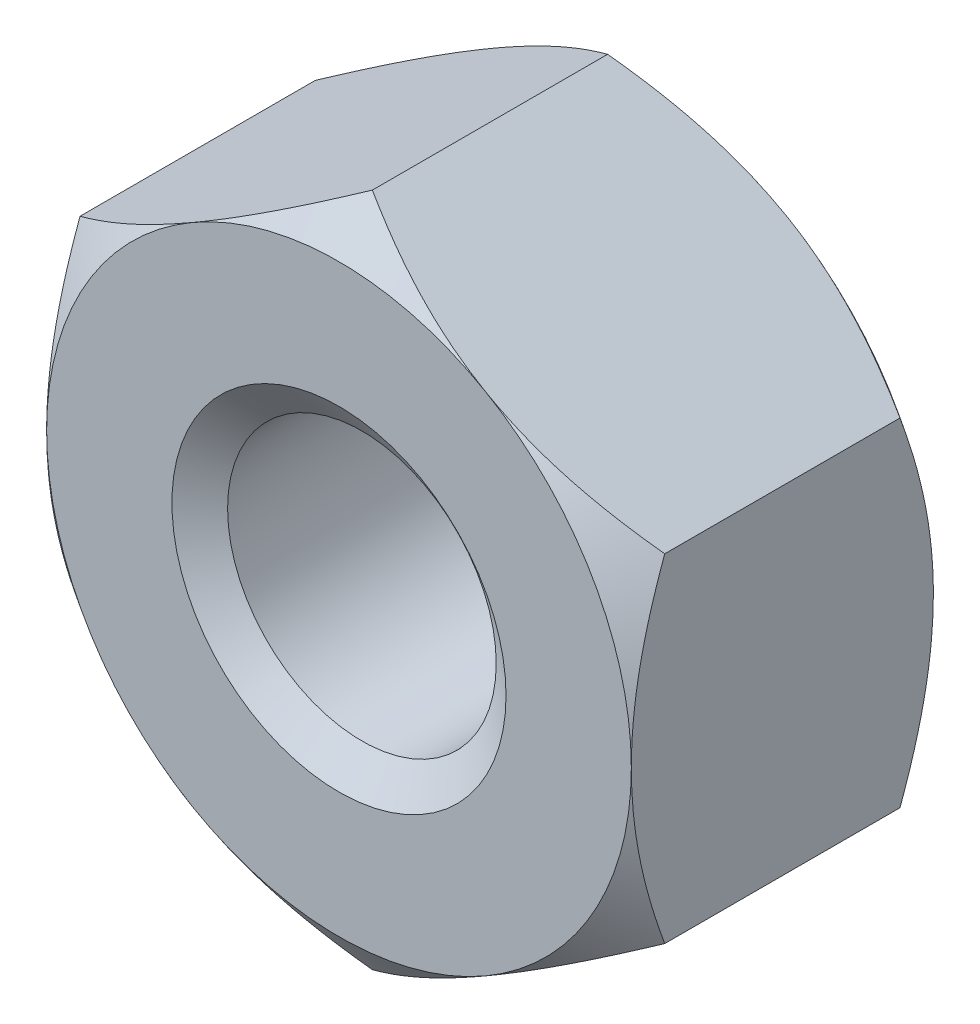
from build123d import *

# Parameters (mm, degrees)
BASENUTSKE_R  = 2.5527
BASENUT_DEPTH = 5.7404


with BuildPart() as part:
    # BaseNutSke → BaseNut (new body)
    with BuildSketch(Plane.XY):
        Polygon((5.55625, 3.207902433), (5.55625, -3.207902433), (0, -6.415804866), (-5.55625, -3.207902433), (-5.55625, 3.207902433), (0, 6.415804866), align=None)
        Circle(BASENUTSKE_R, mode=Mode.SUBTRACT)
    extrude(amount=-BASENUT_DEPTH)

    # Sketch3 → Double-Chamfer (revolve, cut)
    with BuildSketch(Plane(origin=(0, 0, 0), x_dir=(0, 0, -1), z_dir=(1, 0, 0))):
        Polygon((5.7404, 5.55625), (5.1054, 6.415804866), (5.1054, 19.115804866), (18.4404, 19.115804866), (18.4404, 5.55625), align=None)
        Polygon((0.635, 19.115804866), (-12.7, 19.115804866), (-12.7, 5.55625), (0, 5.55625), (0.635, 6.415804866), align=None)
    revolve(axis=Axis((0, 0, 0), (0, 0, -1)), mode=Mode.SUBTRACT)

    # Sketch5 → EndChamfer (revolve, cut)
    with BuildSketch(Plane(origin=(0, 0, 0), x_dir=(0, 0, -1), z_dir=(1, 0, 0)), mode=Mode.PRIVATE) as endchamfer_sk:
        Polygon((5.715, 3.175), (5.235686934, 2.49047), (5.7658, 2.49047), (5.7658, 3.175), align=None)
        Polygon((-0.0508, 3.175), (0, 3.175), (0.479313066, 2.49047), (-0.0508, 2.49047), align=None)
    revolve(endchamfer_sk.sketch.rotate(Axis((0, 0, -25.037505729), (0, 0, -1)), 90), axis=Axis((0, 0, -25.037505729), (0, 0, -1)), mode=Mode.SUBTRACT)


solid = part.part
